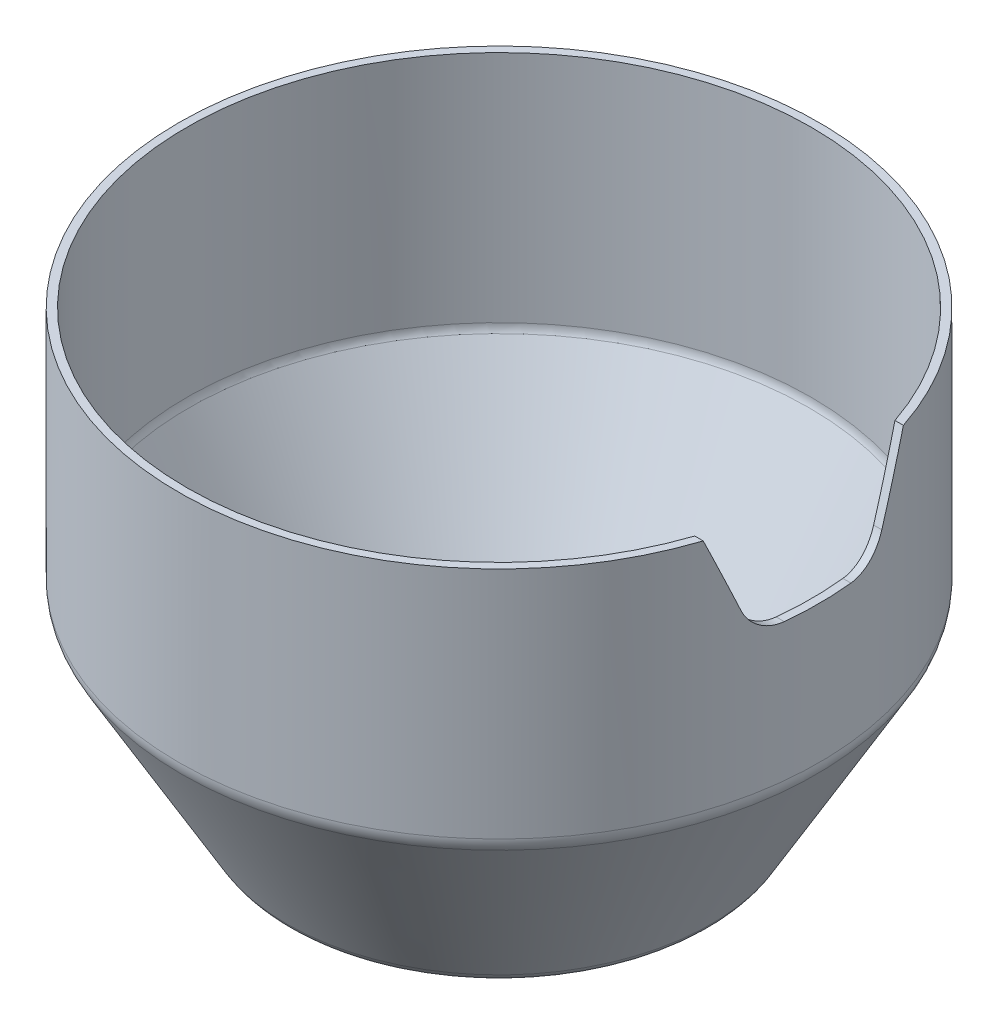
ISO-10303-21;
HEADER;
FILE_DESCRIPTION(('STEP AP214'),'2;1');
FILE_NAME('part.step','',(''),(''),'','','');
FILE_SCHEMA(('AUTOMOTIVE_DESIGN { 1 0 10303 214 1 1 1 1 }'));
ENDSEC;
DATA;
#1=APPLICATION_CONTEXT('core data for automotive mechanical design processes');
#2=APPLICATION_PROTOCOL_DEFINITION('international standard','automotive_design',2000,#1);
#3=PRODUCT_CONTEXT('',#1,'mechanical');
#4=PRODUCT('Part','Part','',(#3));
#5=PRODUCT_RELATED_PRODUCT_CATEGORY('part','',(#4));
#6=PRODUCT_DEFINITION_FORMATION('','',#4);
#7=PRODUCT_DEFINITION_CONTEXT('part definition',#1,'design');
#8=PRODUCT_DEFINITION('design','',#6,#7);
#9=PRODUCT_DEFINITION_SHAPE('','',#8);
#10=(LENGTH_UNIT() NAMED_UNIT(*) SI_UNIT(.MILLI.,.METRE.));
#11=(NAMED_UNIT(*) PLANE_ANGLE_UNIT() SI_UNIT($,.RADIAN.));
#12=(NAMED_UNIT(*) SI_UNIT($,.STERADIAN.) SOLID_ANGLE_UNIT());
#13=UNCERTAINTY_MEASURE_WITH_UNIT(LENGTH_MEASURE(1.E-05),#10,'distance_accuracy_value','');
#14=(GEOMETRIC_REPRESENTATION_CONTEXT(3) GLOBAL_UNCERTAINTY_ASSIGNED_CONTEXT((#13)) GLOBAL_UNIT_ASSIGNED_CONTEXT((#10,
#11,#12)) REPRESENTATION_CONTEXT('',''));
#15=CARTESIAN_POINT('',(0.,0.,0.));
#16=DIRECTION('',(0.,0.,1.));
#17=DIRECTION('',(1.,0.,0.));
#18=AXIS2_PLACEMENT_3D('',#15,#16,#17);
#19=CARTESIAN_POINT('',(0.,0.,0.));
#20=DIRECTION('',(0.,-1.,0.));
#21=DIRECTION('',(0.,0.,-1.));
#22=AXIS2_PLACEMENT_3D('',#19,#20,#21);
#23=CYLINDRICAL_SURFACE('',#22,40.);
#24=CARTESIAN_POINT('',(0.,25.7846096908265,0.));
#25=DIRECTION('',(0.,1.,0.));
#26=DIRECTION('',(0.,0.,1.));
#27=AXIS2_PLACEMENT_3D('',#24,#25,#26);
#28=CIRCLE('',#27,40.);
#29=CARTESIAN_POINT('',(0.,25.7846096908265,40.));
#30=VERTEX_POINT('',#29);
#31=EDGE_CURVE('E125',#30,#30,#28,.T.);
#32=ORIENTED_EDGE('',*,*,#31,.T.);
#33=EDGE_LOOP('',(#32));
#34=FACE_BOUND('',#33,.T.);
#35=CARTESIAN_POINT('',(0.,25.,0.));
#36=DIRECTION('',(0.,0.384615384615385,0.923076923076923));
#37=DIRECTION('',(0.,-0.923076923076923,0.384615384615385));
#38=AXIS2_PLACEMENT_3D('',#35,#36,#37);
#39=ELLIPSE('',#38,104.,40.);
#40=CARTESIAN_POINT('',(37.9967103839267,55.,-12.5));
#41=VERTEX_POINT('',#40);
#42=CARTESIAN_POINT('',(39.024038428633,46.0769230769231,-8.78205128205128));
#43=VERTEX_POINT('',#42);
#44=EDGE_CURVE('E88',#41,#43,#39,.F.);
#45=ORIENTED_EDGE('',*,*,#44,.T.);
#46=CARTESIAN_POINT('',(39.024038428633,46.0769230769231,-8.78205128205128));
#47=CARTESIAN_POINT('',(39.0362640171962,45.9464739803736,-8.7277137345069));
#48=CARTESIAN_POINT('',(39.0496169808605,45.8184393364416,-8.66786044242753));
#49=CARTESIAN_POINT('',(39.0782906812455,45.5680762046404,-8.53766321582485));
#50=CARTESIAN_POINT('',(39.0936110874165,45.4457467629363,-8.46732104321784));
#51=CARTESIAN_POINT('',(39.1259152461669,45.2077871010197,-8.31676964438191));
#52=CARTESIAN_POINT('',(39.1428967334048,45.0921480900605,-8.23657381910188));
#53=CARTESIAN_POINT('',(39.1782288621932,44.8681643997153,-8.06683948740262));
#54=CARTESIAN_POINT('',(39.1965795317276,44.7598198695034,-7.97730079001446));
#55=CARTESIAN_POINT('',(39.2343203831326,44.5511853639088,-7.78956124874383));
#56=CARTESIAN_POINT('',(39.2537101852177,44.450892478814,-7.69136356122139));
#57=CARTESIAN_POINT('',(39.2932142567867,44.2589435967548,-7.48693215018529));
#58=CARTESIAN_POINT('',(39.3133287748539,44.1672906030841,-7.38069565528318));
#59=CARTESIAN_POINT('',(39.3539520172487,43.9932526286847,-7.16093193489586));
#60=CARTESIAN_POINT('',(39.3744607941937,43.9108688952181,-7.04740373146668));
#61=CARTESIAN_POINT('',(39.4155509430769,43.7559313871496,-6.81383901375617));
#62=CARTESIAN_POINT('',(39.4361323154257,43.6833776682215,-6.69380246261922));
#63=CARTESIAN_POINT('',(39.477320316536,43.5477425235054,-6.44647896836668));
#64=CARTESIAN_POINT('',(39.497923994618,43.4847919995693,-6.31911971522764));
#65=CARTESIAN_POINT('',(39.5385881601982,43.369946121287,-6.05948062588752));
#66=CARTESIAN_POINT('',(39.5586488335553,43.3180469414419,-5.92720251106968));
#67=CARTESIAN_POINT('',(39.5979492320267,43.2256939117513,-5.65869334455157));
#68=CARTESIAN_POINT('',(39.6171895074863,43.1852322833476,-5.52246504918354));
#69=CARTESIAN_POINT('',(39.6546162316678,43.1160363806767,-5.24697388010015));
#70=CARTESIAN_POINT('',(39.6728030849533,43.0872975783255,-5.10771220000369));
#71=CARTESIAN_POINT('',(39.706917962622,43.0430735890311,-4.83512218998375));
#72=CARTESIAN_POINT('',(39.7229156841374,43.0269245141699,-4.70190992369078));
#73=CARTESIAN_POINT('',(39.7536350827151,43.0053914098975,-4.43471296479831));
#74=CARTESIAN_POINT('',(39.768358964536,42.9999884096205,-4.30073005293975));
#75=CARTESIAN_POINT('',(39.7823942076,43.,-4.16666666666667));
#76=B_SPLINE_CURVE_WITH_KNOTS('',3,(#46,#47,#48,#49,#50,#51,#52,#53,#54,#55,#56,#57,#58,#59,#60,
#61,#62,#63,#64,#65,#66,#67,#68,#69,#70,#71,#72,#73,#74,#75),.UNSPECIFIED.,.F.,.F.,(4,2,2,2,2,2,
2,2,2,2,2,2,2,2,4),(0.,0.425378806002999,0.850686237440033,1.275421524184,1.70016549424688,
2.12475527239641,2.54949210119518,2.97428601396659,3.39908233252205,3.82923229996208,
4.25923312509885,4.68894080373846,5.1184823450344,5.52346230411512,5.92772668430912),.UNSPECIFIED.);
#77=CARTESIAN_POINT('',(39.7823942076,43.,-4.16666666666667));
#78=VERTEX_POINT('',#77);
#79=EDGE_CURVE('E174',#43,#78,#76,.T.);
#80=ORIENTED_EDGE('',*,*,#79,.T.);
#81=CARTESIAN_POINT('',(0.,43.,0.));
#82=DIRECTION('',(0.,1.,0.));
#83=DIRECTION('',(0.,0.,1.));
#84=AXIS2_PLACEMENT_3D('',#81,#82,#83);
#85=CIRCLE('',#84,40.);
#86=CARTESIAN_POINT('',(39.7823942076,43.,4.16666666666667));
#87=VERTEX_POINT('',#86);
#88=EDGE_CURVE('E98',#78,#87,#85,.F.);
#89=ORIENTED_EDGE('',*,*,#88,.T.);
#90=CARTESIAN_POINT('',(39.7823942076,43.,4.16666666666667));
#91=CARTESIAN_POINT('',(39.7675515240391,42.999984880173,4.3084547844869));
#92=CARTESIAN_POINT('',(39.751936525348,43.0060304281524,4.45015559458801));
#93=CARTESIAN_POINT('',(39.7193248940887,43.0300904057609,4.7323608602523));
#94=CARTESIAN_POINT('',(39.7023284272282,43.0481034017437,4.8728654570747));
#95=CARTESIAN_POINT('',(39.6671341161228,43.0959175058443,5.15152557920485));
#96=CARTESIAN_POINT('',(39.6489377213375,43.1257046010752,5.28968369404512));
#97=CARTESIAN_POINT('',(39.6115337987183,43.196816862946,5.56285768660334));
#98=CARTESIAN_POINT('',(39.5923262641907,43.238142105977,5.69787354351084));
#99=CARTESIAN_POINT('',(39.5531419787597,43.3320070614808,5.96380972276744));
#100=CARTESIAN_POINT('',(39.5331653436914,43.3845450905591,6.09473065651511));
#101=CARTESIAN_POINT('',(39.4927016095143,43.5004752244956,6.35164842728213));
#102=CARTESIAN_POINT('',(39.4722143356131,43.5638710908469,6.4776435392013));
#103=CARTESIAN_POINT('',(39.4310264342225,43.7010659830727,6.72381835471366));
#104=CARTESIAN_POINT('',(39.4103257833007,43.7748661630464,6.8439974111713));
#105=CARTESIAN_POINT('',(39.3690252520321,43.9323592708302,7.0777068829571));
#106=CARTESIAN_POINT('',(39.348425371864,44.0160522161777,7.19123728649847));
#107=CARTESIAN_POINT('',(39.3074853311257,44.1934897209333,7.41176625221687));
#108=CARTESIAN_POINT('',(39.287148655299,44.2873106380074,7.51870404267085));
#109=CARTESIAN_POINT('',(39.2472562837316,44.4837664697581,7.72423664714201));
#110=CARTESIAN_POINT('',(39.2277003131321,44.5863982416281,7.82283441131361));
#111=CARTESIAN_POINT('',(39.1897178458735,44.79972784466,8.01094369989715));
#112=CARTESIAN_POINT('',(39.1712904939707,44.9104194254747,8.10046213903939));
#113=CARTESIAN_POINT('',(39.1358895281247,45.1391403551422,8.26980227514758));
#114=CARTESIAN_POINT('',(39.1189153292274,45.2571667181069,8.3496278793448));
#115=CARTESIAN_POINT('',(39.0880427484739,45.4899066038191,8.49292965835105));
#116=CARTESIAN_POINT('',(39.0740064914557,45.6041090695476,8.55720747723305));
#117=CARTESIAN_POINT('',(39.0476726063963,45.8371623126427,8.67657490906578));
#118=CARTESIAN_POINT('',(39.0353720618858,45.956004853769,8.73167996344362));
#119=CARTESIAN_POINT('',(39.024038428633,46.0769230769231,8.78205128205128));
#120=B_SPLINE_CURVE_WITH_KNOTS('',3,(#90,#91,#92,#93,#94,#95,#96,#97,#98,#99,#100,#101,#102,
#103,#104,#105,#106,#107,#108,#109,#110,#111,#112,#113,#114,#115,#116,#117,#118,#119),
.UNSPECIFIED.,.F.,.F.,(4,2,2,2,2,2,2,2,2,2,2,2,2,2,4),(0.,0.427549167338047,0.855047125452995,
1.28203782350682,1.70903134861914,2.1359608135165,2.56303848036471,2.99016355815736,
3.41728939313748,3.84789611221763,4.27834986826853,4.70847329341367,5.13842275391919,
5.53340992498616,5.92772529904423),.UNSPECIFIED.);
#121=CARTESIAN_POINT('',(39.024038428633,46.0769230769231,8.78205128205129));
#122=VERTEX_POINT('',#121);
#123=EDGE_CURVE('E11',#87,#122,#120,.T.);
#124=ORIENTED_EDGE('',*,*,#123,.T.);
#125=CARTESIAN_POINT('',(0.,25.,0.));
#126=DIRECTION('',(0.,0.384615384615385,-0.923076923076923));
#127=DIRECTION('',(0.,-0.923076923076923,-0.384615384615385));
#128=AXIS2_PLACEMENT_3D('',#125,#126,#127);
#129=ELLIPSE('',#128,104.,40.);
#130=CARTESIAN_POINT('',(37.9967103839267,55.,12.5));
#131=VERTEX_POINT('',#130);
#132=EDGE_CURVE('E109',#122,#131,#129,.F.);
#133=ORIENTED_EDGE('',*,*,#132,.T.);
#134=CARTESIAN_POINT('',(0.,55.,0.));
#135=DIRECTION('',(0.,-1.,0.));
#136=DIRECTION('',(0.,0.,-1.));
#137=AXIS2_PLACEMENT_3D('',#134,#135,#136);
#138=CIRCLE('',#137,40.);
#139=EDGE_CURVE('E105',#131,#41,#138,.T.);
#140=ORIENTED_EDGE('',*,*,#139,.T.);
#141=EDGE_LOOP('',(#45,#80,#89,#124,#133,#140));
#142=FACE_BOUND('',#141,.T.);
#143=ADVANCED_FACE('F31',(#34,#142),#23,.T.);
#144=CARTESIAN_POINT('',(40.,55.,0.));
#145=DIRECTION('',(0.,1.,0.));
#146=DIRECTION('',(0.,0.,1.));
#147=AXIS2_PLACEMENT_3D('',#144,#145,#146);
#148=PLANE('',#147);
#149=ORIENTED_EDGE('',*,*,#139,.F.);
#150=DIRECTION('',(-1.,0.,0.));
#151=VECTOR('',#150,1.);
#152=CARTESIAN_POINT('',(40.,55.,12.5));
#153=LINE('',#152,#151);
#154=CARTESIAN_POINT('',(36.9425229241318,55.,12.5));
#155=VERTEX_POINT('',#154);
#156=EDGE_CURVE('E99',#131,#155,#153,.T.);
#157=ORIENTED_EDGE('',*,*,#156,.T.);
#158=CARTESIAN_POINT('',(0.,55.,0.));
#159=DIRECTION('',(0.,-1.,0.));
#160=DIRECTION('',(0.,0.,-1.));
#161=AXIS2_PLACEMENT_3D('',#158,#159,#160);
#162=CIRCLE('',#161,39.);
#163=CARTESIAN_POINT('',(36.9425229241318,55.,-12.5));
#164=VERTEX_POINT('',#163);
#165=EDGE_CURVE('E107',#155,#164,#162,.T.);
#166=ORIENTED_EDGE('',*,*,#165,.T.);
#167=DIRECTION('',(-1.,0.,0.));
#168=VECTOR('',#167,1.);
#169=CARTESIAN_POINT('',(40.,55.,-12.5));
#170=LINE('',#169,#168);
#171=EDGE_CURVE('E92',#41,#164,#170,.T.);
#172=ORIENTED_EDGE('',*,*,#171,.F.);
#173=EDGE_LOOP('',(#149,#157,#166,#172));
#174=FACE_BOUND('',#173,.T.);
#175=ADVANCED_FACE('F103',(#174),#148,.T.);
#176=CARTESIAN_POINT('',(0.,0.,0.));
#177=DIRECTION('',(0.,-1.,0.));
#178=DIRECTION('',(0.,0.,-1.));
#179=AXIS2_PLACEMENT_3D('',#176,#177,#178);
#180=CYLINDRICAL_SURFACE('',#179,39.);
#181=CARTESIAN_POINT('',(0.,25.7846096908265,0.));
#182=DIRECTION('',(0.,-1.,0.));
#183=DIRECTION('',(0.,0.,-1.));
#184=AXIS2_PLACEMENT_3D('',#181,#182,#183);
#185=CIRCLE('',#184,39.);
#186=CARTESIAN_POINT('',(0.,25.7846096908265,-39.));
#187=VERTEX_POINT('',#186);
#188=EDGE_CURVE('E128',#187,#187,#185,.T.);
#189=ORIENTED_EDGE('',*,*,#188,.T.);
#190=EDGE_LOOP('',(#189));
#191=FACE_BOUND('',#190,.T.);
#192=ORIENTED_EDGE('',*,*,#165,.F.);
#193=CARTESIAN_POINT('',(0.,25.,0.));
#194=DIRECTION('',(0.,0.384615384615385,-0.923076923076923));
#195=DIRECTION('',(0.,-0.923076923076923,-0.384615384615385));
#196=AXIS2_PLACEMENT_3D('',#193,#194,#195);
#197=ELLIPSE('',#196,101.4,39.);
#198=CARTESIAN_POINT('',(37.9983627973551,46.0769230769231,8.78205128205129));
#199=VERTEX_POINT('',#198);
#200=EDGE_CURVE('E156',#155,#199,#197,.T.);
#201=ORIENTED_EDGE('',*,*,#200,.T.);
#202=CARTESIAN_POINT('',(37.9983627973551,46.0769230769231,8.78205128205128));
#203=CARTESIAN_POINT('',(38.010921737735,45.9464393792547,8.7276993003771));
#204=CARTESIAN_POINT('',(38.024638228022,45.8183766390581,8.66783088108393));
#205=CARTESIAN_POINT('',(38.0540905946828,45.5679699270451,8.53760490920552));
#206=CARTESIAN_POINT('',(38.0698261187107,45.4456249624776,8.46724918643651));
#207=CARTESIAN_POINT('',(38.103002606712,45.2076482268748,8.31667657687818));
#208=CARTESIAN_POINT('',(38.1204411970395,45.0920074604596,8.23647337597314));
#209=CARTESIAN_POINT('',(38.1567216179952,44.8680277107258,8.06672977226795));
#210=CARTESIAN_POINT('',(38.1755634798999,44.7596888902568,7.9771891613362));
#211=CARTESIAN_POINT('',(38.2143111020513,44.5510739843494,7.78945478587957));
#212=CARTESIAN_POINT('',(38.2342164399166,44.4507947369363,7.69126444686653));
#213=CARTESIAN_POINT('',(38.2747681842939,44.2588746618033,7.48685374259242));
#214=CARTESIAN_POINT('',(38.2954148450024,44.1672368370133,7.38063060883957));
#215=CARTESIAN_POINT('',(38.3371108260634,43.9932267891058,7.16089645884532));
#216=CARTESIAN_POINT('',(38.3581602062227,43.9108559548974,7.04738435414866));
#217=CARTESIAN_POINT('',(38.4003316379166,43.7559414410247,6.81385403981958));
#218=CARTESIAN_POINT('',(38.4214536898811,43.6833978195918,6.69383579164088));
#219=CARTESIAN_POINT('',(38.4637357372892,43.5477359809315,6.44647049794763));
#220=CARTESIAN_POINT('',(38.4848925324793,43.4847552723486,6.31904745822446));
#221=CARTESIAN_POINT('',(38.5266468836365,43.3698586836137,6.05927216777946));
#222=CARTESIAN_POINT('',(38.5472446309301,43.3179389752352,5.92692164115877));
#223=CARTESIAN_POINT('',(38.5875955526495,43.2255561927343,5.65825983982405));
#224=CARTESIAN_POINT('',(38.6073493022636,43.1850852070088,5.52195137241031));
#225=CARTESIAN_POINT('',(38.6457733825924,43.1158828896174,5.24629061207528));
#226=CARTESIAN_POINT('',(38.6644441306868,43.087147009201,5.10693952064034));
#227=CARTESIAN_POINT('',(38.6994347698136,43.0429809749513,4.83440419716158));
#228=CARTESIAN_POINT('',(38.7158283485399,43.0268671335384,4.70133983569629));
#229=CARTESIAN_POINT('',(38.7473090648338,43.0053803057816,4.43443280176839));
#230=CARTESIAN_POINT('',(38.7623984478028,42.9999884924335,4.3005919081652));
#231=CARTESIAN_POINT('',(38.7767828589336,43.,4.16666666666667));
#232=B_SPLINE_CURVE_WITH_KNOTS('',3,(#202,#203,#204,#205,#206,#207,#208,#209,#210,#211,#212,
#213,#214,#215,#216,#217,#218,#219,#220,#221,#222,#223,#224,#225,#226,#227,#228,#229,#230,#231),
.UNSPECIFIED.,.F.,.F.,(4,2,2,2,2,2,2,2,2,2,2,2,2,2,4),(0.,0.425577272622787,0.851080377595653,
1.27599867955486,1.70092645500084,2.12568669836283,2.55059400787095,2.9755649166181,
3.40053834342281,3.831138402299,4.26158918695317,4.69174177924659,5.1217274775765,
5.52640127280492,5.93036386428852),.UNSPECIFIED.);
#233=CARTESIAN_POINT('',(38.7767828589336,43.,4.16666666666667));
#234=VERTEX_POINT('',#233);
#235=EDGE_CURVE('E44',#199,#234,#232,.T.);
#236=ORIENTED_EDGE('',*,*,#235,.T.);
#237=CARTESIAN_POINT('',(0.,43.,0.));
#238=DIRECTION('',(0.,1.,0.));
#239=DIRECTION('',(0.,0.,1.));
#240=AXIS2_PLACEMENT_3D('',#237,#238,#239);
#241=CIRCLE('',#240,39.);
#242=CARTESIAN_POINT('',(38.7767828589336,43.,-4.16666666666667));
#243=VERTEX_POINT('',#242);
#244=EDGE_CURVE('E153',#234,#243,#241,.T.);
#245=ORIENTED_EDGE('',*,*,#244,.T.);
#246=CARTESIAN_POINT('',(38.7767828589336,43.,-4.16666666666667));
#247=CARTESIAN_POINT('',(38.7615488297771,42.9999848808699,-4.30851467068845));
#248=CARTESIAN_POINT('',(38.7455218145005,43.0060355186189,-4.45027081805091));
#249=CARTESIAN_POINT('',(38.7120492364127,43.0301135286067,-4.73257661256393));
#250=CARTESIAN_POINT('',(38.6946038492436,43.0481394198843,-4.87312640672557));
#251=CARTESIAN_POINT('',(38.6584799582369,43.0959842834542,-5.15186364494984));
#252=CARTESIAN_POINT('',(38.639802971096,43.1257889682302,-5.29005374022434));
#253=CARTESIAN_POINT('',(38.6014107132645,43.19693945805,-5.56328254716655));
#254=CARTESIAN_POINT('',(38.5816954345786,43.2382853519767,-5.69832123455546));
#255=CARTESIAN_POINT('',(38.5414751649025,43.3321922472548,-5.96429239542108));
#256=CARTESIAN_POINT('',(38.5209703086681,43.3847513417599,-6.09522556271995));
#257=CARTESIAN_POINT('',(38.479435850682,43.5007240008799,-6.35216176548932));
#258=CARTESIAN_POINT('',(38.4584060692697,43.5641413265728,-6.47816307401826));
#259=CARTESIAN_POINT('',(38.4161261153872,43.7013806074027,-6.7243481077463));
#260=CARTESIAN_POINT('',(38.3948759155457,43.7752038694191,-6.84453109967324));
#261=CARTESIAN_POINT('',(38.3524776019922,43.9327447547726,-7.0782462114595));
#262=CARTESIAN_POINT('',(38.3313294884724,44.0164623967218,-7.19177831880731));
#263=CARTESIAN_POINT('',(38.2892896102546,44.193989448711,-7.41235568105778));
#264=CARTESIAN_POINT('',(38.2684015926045,44.2878791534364,-7.51933704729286));
#265=CARTESIAN_POINT('',(38.2274265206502,44.4844848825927,-7.72494979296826));
#266=CARTESIAN_POINT('',(38.2073391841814,44.5871977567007,-7.82358412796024));
#267=CARTESIAN_POINT('',(38.1683242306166,44.8007016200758,-8.01175729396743));
#268=CARTESIAN_POINT('',(38.1493957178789,44.9114862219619,-8.1013031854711));
#269=CARTESIAN_POINT('',(38.1130319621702,45.1404077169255,-8.27068888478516));
#270=CARTESIAN_POINT('',(38.0955961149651,45.2585416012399,-8.35053262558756));
#271=CARTESIAN_POINT('',(38.0639308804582,45.4911641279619,-8.49364995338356));
#272=CARTESIAN_POINT('',(38.049555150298,45.6051237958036,-8.55775237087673));
#273=CARTESIAN_POINT('',(38.0225798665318,45.8376783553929,-8.67681389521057));
#274=CARTESIAN_POINT('',(38.009977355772,45.9562650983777,-8.73178825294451));
#275=CARTESIAN_POINT('',(37.9983627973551,46.0769230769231,-8.78205128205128));
#276=B_SPLINE_CURVE_WITH_KNOTS('',3,(#246,#247,#248,#249,#250,#251,#252,#253,#254,#255,#256,
#257,#258,#259,#260,#261,#262,#263,#264,#265,#266,#267,#268,#269,#270,#271,#272,#273,#274,#275),
.UNSPECIFIED.,.F.,.F.,(4,2,2,2,2,2,2,2,2,2,2,2,2,2,4),(0.,0.427851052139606,0.855649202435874,
1.28293002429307,1.7102141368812,2.13742564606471,2.56478543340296,2.99219894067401,
3.41961325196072,3.85068837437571,4.28161021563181,4.71219468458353,5.14260401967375,
5.53681590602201,5.93036237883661),.UNSPECIFIED.);
#277=CARTESIAN_POINT('',(37.9983627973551,46.0769230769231,-8.78205128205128));
#278=VERTEX_POINT('',#277);
#279=EDGE_CURVE('E167',#243,#278,#276,.T.);
#280=ORIENTED_EDGE('',*,*,#279,.T.);
#281=CARTESIAN_POINT('',(0.,25.,0.));
#282=DIRECTION('',(0.,0.384615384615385,0.923076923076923));
#283=DIRECTION('',(0.,-0.923076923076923,0.384615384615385));
#284=AXIS2_PLACEMENT_3D('',#281,#282,#283);
#285=ELLIPSE('',#284,101.4,39.);
#286=EDGE_CURVE('E140',#278,#164,#285,.T.);
#287=ORIENTED_EDGE('',*,*,#286,.T.);
#288=EDGE_LOOP('',(#192,#201,#236,#245,#280,#287));
#289=FACE_BOUND('',#288,.T.);
#290=ADVANCED_FACE('F181',(#191,#289),#180,.F.);
#291=CARTESIAN_POINT('',(0.,0.,0.));
#292=DIRECTION('',(0.,-1.,0.));
#293=DIRECTION('',(0.,0.,-1.));
#294=AXIS2_PLACEMENT_3D('',#291,#292,#293);
#295=PLANE('',#294);
#296=CARTESIAN_POINT('',(0.,0.,-18.));
#297=DIRECTION('',(0.,-1.,0.));
#298=DIRECTION('',(0.,0.,-1.));
#299=AXIS2_PLACEMENT_3D('',#296,#297,#298);
#300=CIRCLE('',#299,3.);
#301=CARTESIAN_POINT('',(0.,0.,-21.));
#302=VERTEX_POINT('',#301);
#303=EDGE_CURVE('E151',#302,#302,#300,.T.);
#304=ORIENTED_EDGE('',*,*,#303,.F.);
#305=EDGE_LOOP('',(#304));
#306=FACE_BOUND('',#305,.T.);
#307=CARTESIAN_POINT('',(0.,0.,18.));
#308=DIRECTION('',(0.,-1.,0.));
#309=DIRECTION('',(0.,0.,-1.));
#310=AXIS2_PLACEMENT_3D('',#307,#308,#309);
#311=CIRCLE('',#310,3.);
#312=CARTESIAN_POINT('',(0.,0.,15.));
#313=VERTEX_POINT('',#312);
#314=EDGE_CURVE('E147',#313,#313,#311,.T.);
#315=ORIENTED_EDGE('',*,*,#314,.F.);
#316=EDGE_LOOP('',(#315));
#317=FACE_BOUND('',#316,.T.);
#318=CARTESIAN_POINT('',(0.,0.,0.));
#319=DIRECTION('',(0.,-1.,0.));
#320=DIRECTION('',(0.,0.,-1.));
#321=AXIS2_PLACEMENT_3D('',#318,#319,#320);
#322=CIRCLE('',#321,11.);
#323=CARTESIAN_POINT('',(0.,0.,-11.));
#324=VERTEX_POINT('',#323);
#325=EDGE_CURVE('E143',#324,#324,#322,.T.);
#326=ORIENTED_EDGE('',*,*,#325,.F.);
#327=EDGE_LOOP('',(#326));
#328=FACE_BOUND('',#327,.T.);
#329=CARTESIAN_POINT('',(0.,0.,0.));
#330=DIRECTION('',(0.,-1.,0.));
#331=DIRECTION('',(0.,0.,-1.));
#332=AXIS2_PLACEMENT_3D('',#329,#330,#331);
#333=CIRCLE('',#332,23.8452994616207);
#334=CARTESIAN_POINT('',(0.,0.,-23.8452994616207));
#335=VERTEX_POINT('',#334);
#336=EDGE_CURVE('E111',#335,#335,#333,.T.);
#337=ORIENTED_EDGE('',*,*,#336,.T.);
#338=EDGE_LOOP('',(#337));
#339=FACE_BOUND('',#338,.T.);
#340=ADVANCED_FACE('F33',(#306,#317,#328,#339),#295,.T.);
#341=CARTESIAN_POINT('',(0.,0.,0.));
#342=DIRECTION('',(0.,1.,0.));
#343=DIRECTION('',(0.,0.,1.));
#344=AXIS2_PLACEMENT_3D('',#341,#342,#343);
#345=CONICAL_SURFACE('',#344,25.5773502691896,0.5235987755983);
#346=CARTESIAN_POINT('',(0.,1.5,0.));
#347=DIRECTION('',(0.,-1.,0.));
#348=DIRECTION('',(0.,0.,-1.));
#349=AXIS2_PLACEMENT_3D('',#346,#347,#348);
#350=CIRCLE('',#349,26.4433756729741);
#351=CARTESIAN_POINT('',(0.,1.5,-26.4433756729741));
#352=VERTEX_POINT('',#351);
#353=EDGE_CURVE('E122',#352,#352,#350,.F.);
#354=ORIENTED_EDGE('',*,*,#353,.T.);
#355=EDGE_LOOP('',(#354));
#356=FACE_BOUND('',#355,.T.);
#357=CARTESIAN_POINT('',(0.,24.2846096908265,0.));
#358=DIRECTION('',(0.,-1.,0.));
#359=DIRECTION('',(0.,0.,-1.));
#360=AXIS2_PLACEMENT_3D('',#357,#358,#359);
#361=CIRCLE('',#360,39.5980762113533);
#362=CARTESIAN_POINT('',(0.,24.2846096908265,-39.5980762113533));
#363=VERTEX_POINT('',#362);
#364=EDGE_CURVE('E114',#363,#363,#361,.T.);
#365=ORIENTED_EDGE('',*,*,#364,.T.);
#366=EDGE_LOOP('',(#365));
#367=FACE_BOUND('',#366,.T.);
#368=ADVANCED_FACE('F207',(#356,#367),#345,.T.);
#369=CARTESIAN_POINT('',(0.,25.2487113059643,0.));
#370=DIRECTION('',(0.,1.,0.));
#371=DIRECTION('',(0.,0.,1.));
#372=AXIS2_PLACEMENT_3D('',#369,#370,#371);
#373=CONICAL_SURFACE('',#372,39.,0.523598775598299);
#374=CARTESIAN_POINT('',(0.,24.7846096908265,0.));
#375=DIRECTION('',(0.,1.,0.));
#376=DIRECTION('',(0.,0.,1.));
#377=AXIS2_PLACEMENT_3D('',#374,#375,#376);
#378=CIRCLE('',#377,38.7320508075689);
#379=CARTESIAN_POINT('',(0.,24.7846096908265,38.7320508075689));
#380=VERTEX_POINT('',#379);
#381=EDGE_CURVE('E134',#380,#380,#378,.T.);
#382=ORIENTED_EDGE('',*,*,#381,.T.);
#383=EDGE_LOOP('',(#382));
#384=FACE_BOUND('',#383,.T.);
#385=CARTESIAN_POINT('',(0.,2.,0.));
#386=DIRECTION('',(0.,1.,0.));
#387=DIRECTION('',(0.,0.,1.));
#388=AXIS2_PLACEMENT_3D('',#385,#386,#387);
#389=CIRCLE('',#388,25.5773502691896);
#390=CARTESIAN_POINT('',(0.,2.,25.5773502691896));
#391=VERTEX_POINT('',#390);
#392=EDGE_CURVE('E131',#391,#391,#389,.F.);
#393=ORIENTED_EDGE('',*,*,#392,.T.);
#394=EDGE_LOOP('',(#393));
#395=FACE_BOUND('',#394,.T.);
#396=ADVANCED_FACE('F187',(#384,#395),#373,.F.);
#397=CARTESIAN_POINT('',(25.,1.,0.));
#398=DIRECTION('',(0.,1.,0.));
#399=DIRECTION('',(0.,0.,1.));
#400=AXIS2_PLACEMENT_3D('',#397,#398,#399);
#401=PLANE('',#400);
#402=CARTESIAN_POINT('',(0.,1.,-18.));
#403=DIRECTION('',(0.,1.,0.));
#404=DIRECTION('',(0.,0.,1.));
#405=AXIS2_PLACEMENT_3D('',#402,#403,#404);
#406=CIRCLE('',#405,3.);
#407=CARTESIAN_POINT('',(0.,1.,-15.));
#408=VERTEX_POINT('',#407);
#409=EDGE_CURVE('E148',#408,#408,#406,.T.);
#410=ORIENTED_EDGE('',*,*,#409,.F.);
#411=EDGE_LOOP('',(#410));
#412=FACE_BOUND('',#411,.T.);
#413=CARTESIAN_POINT('',(0.,1.,18.));
#414=DIRECTION('',(0.,1.,0.));
#415=DIRECTION('',(0.,0.,1.));
#416=AXIS2_PLACEMENT_3D('',#413,#414,#415);
#417=CIRCLE('',#416,3.);
#418=CARTESIAN_POINT('',(0.,1.,21.));
#419=VERTEX_POINT('',#418);
#420=EDGE_CURVE('E144',#419,#419,#417,.T.);
#421=ORIENTED_EDGE('',*,*,#420,.F.);
#422=EDGE_LOOP('',(#421));
#423=FACE_BOUND('',#422,.T.);
#424=CARTESIAN_POINT('',(0.,1.,0.));
#425=DIRECTION('',(0.,1.,0.));
#426=DIRECTION('',(0.,0.,1.));
#427=AXIS2_PLACEMENT_3D('',#424,#425,#426);
#428=CIRCLE('',#427,11.);
#429=CARTESIAN_POINT('',(0.,1.,11.));
#430=VERTEX_POINT('',#429);
#431=EDGE_CURVE('E116',#430,#430,#428,.T.);
#432=ORIENTED_EDGE('',*,*,#431,.F.);
#433=EDGE_LOOP('',(#432));
#434=FACE_BOUND('',#433,.T.);
#435=CARTESIAN_POINT('',(0.,1.,0.));
#436=DIRECTION('',(0.,1.,0.));
#437=DIRECTION('',(0.,0.,1.));
#438=AXIS2_PLACEMENT_3D('',#435,#436,#437);
#439=CIRCLE('',#438,23.8452994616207);
#440=CARTESIAN_POINT('',(0.,1.,23.8452994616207));
#441=VERTEX_POINT('',#440);
#442=EDGE_CURVE('E137',#441,#441,#439,.T.);
#443=ORIENTED_EDGE('',*,*,#442,.T.);
#444=EDGE_LOOP('',(#443));
#445=FACE_BOUND('',#444,.T.);
#446=ADVANCED_FACE('F215',(#412,#423,#434,#445),#401,.T.);
#447=CARTESIAN_POINT('',(0.,3.,0.));
#448=DIRECTION('',(0.,-1.,0.));
#449=DIRECTION('',(0.,0.,-1.));
#450=AXIS2_PLACEMENT_3D('',#447,#448,#449);
#451=TOROIDAL_SURFACE('',#450,23.8452994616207,3.);
#452=ORIENTED_EDGE('',*,*,#353,.F.);
#453=EDGE_LOOP('',(#452));
#454=FACE_BOUND('',#453,.T.);
#455=ORIENTED_EDGE('',*,*,#336,.F.);
#456=EDGE_LOOP('',(#455));
#457=FACE_BOUND('',#456,.T.);
#458=ADVANCED_FACE('F225',(#454,#457),#451,.T.);
#459=CARTESIAN_POINT('',(0.,25.7846096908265,0.));
#460=DIRECTION('',(0.,1.,0.));
#461=DIRECTION('',(0.,0.,1.));
#462=AXIS2_PLACEMENT_3D('',#459,#460,#461);
#463=TOROIDAL_SURFACE('',#462,37.,3.);
#464=ORIENTED_EDGE('',*,*,#31,.F.);
#465=EDGE_LOOP('',(#464));
#466=FACE_BOUND('',#465,.T.);
#467=ORIENTED_EDGE('',*,*,#364,.F.);
#468=EDGE_LOOP('',(#467));
#469=FACE_BOUND('',#468,.T.);
#470=ADVANCED_FACE('F222',(#466,#469),#463,.T.);
#471=CARTESIAN_POINT('',(0.,25.7846096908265,0.));
#472=DIRECTION('',(0.,-1.,0.));
#473=DIRECTION('',(0.,0.,-1.));
#474=AXIS2_PLACEMENT_3D('',#471,#472,#473);
#475=TOROIDAL_SURFACE('',#474,37.,2.);
#476=ORIENTED_EDGE('',*,*,#381,.F.);
#477=EDGE_LOOP('',(#476));
#478=FACE_BOUND('',#477,.T.);
#479=ORIENTED_EDGE('',*,*,#188,.F.);
#480=EDGE_LOOP('',(#479));
#481=FACE_BOUND('',#480,.T.);
#482=ADVANCED_FACE('F224',(#478,#481),#475,.F.);
#483=CARTESIAN_POINT('',(0.,3.,0.));
#484=DIRECTION('',(0.,1.,0.));
#485=DIRECTION('',(0.,0.,1.));
#486=AXIS2_PLACEMENT_3D('',#483,#484,#485);
#487=TOROIDAL_SURFACE('',#486,23.8452994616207,2.);
#488=ORIENTED_EDGE('',*,*,#442,.F.);
#489=EDGE_LOOP('',(#488));
#490=FACE_BOUND('',#489,.T.);
#491=ORIENTED_EDGE('',*,*,#392,.F.);
#492=EDGE_LOOP('',(#491));
#493=FACE_BOUND('',#492,.T.);
#494=ADVANCED_FACE('F232',(#490,#493),#487,.F.);
#495=CARTESIAN_POINT('',(0.,55.,0.));
#496=DIRECTION('',(0.,-1.,0.));
#497=DIRECTION('',(0.,0.,-1.));
#498=AXIS2_PLACEMENT_3D('',#495,#496,#497);
#499=CYLINDRICAL_SURFACE('',#498,11.);
#500=ORIENTED_EDGE('',*,*,#431,.T.);
#501=EDGE_LOOP('',(#500));
#502=FACE_BOUND('',#501,.T.);
#503=ORIENTED_EDGE('',*,*,#325,.T.);
#504=EDGE_LOOP('',(#503));
#505=FACE_BOUND('',#504,.T.);
#506=ADVANCED_FACE('F253',(#502,#505),#499,.F.);
#507=CARTESIAN_POINT('',(0.,55.,18.));
#508=DIRECTION('',(0.,-1.,0.));
#509=DIRECTION('',(0.,0.,-1.));
#510=AXIS2_PLACEMENT_3D('',#507,#508,#509);
#511=CYLINDRICAL_SURFACE('',#510,3.);
#512=ORIENTED_EDGE('',*,*,#420,.T.);
#513=EDGE_LOOP('',(#512));
#514=FACE_BOUND('',#513,.T.);
#515=ORIENTED_EDGE('',*,*,#314,.T.);
#516=EDGE_LOOP('',(#515));
#517=FACE_BOUND('',#516,.T.);
#518=ADVANCED_FACE('F259',(#514,#517),#511,.F.);
#519=CARTESIAN_POINT('',(0.,55.,-18.));
#520=DIRECTION('',(0.,-1.,0.));
#521=DIRECTION('',(0.,0.,-1.));
#522=AXIS2_PLACEMENT_3D('',#519,#520,#521);
#523=CYLINDRICAL_SURFACE('',#522,3.);
#524=ORIENTED_EDGE('',*,*,#409,.T.);
#525=EDGE_LOOP('',(#524));
#526=FACE_BOUND('',#525,.T.);
#527=ORIENTED_EDGE('',*,*,#303,.T.);
#528=EDGE_LOOP('',(#527));
#529=FACE_BOUND('',#528,.T.);
#530=ADVANCED_FACE('F265',(#526,#529),#523,.F.);
#531=CARTESIAN_POINT('',(40.,55.,12.5));
#532=DIRECTION('',(0.,0.384615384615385,-0.923076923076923));
#533=DIRECTION('',(0.,0.923076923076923,0.384615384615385));
#534=AXIS2_PLACEMENT_3D('',#531,#532,#533);
#535=PLANE('',#534);
#536=ORIENTED_EDGE('',*,*,#132,.F.);
#537=DIRECTION('',(-1.,0.,0.));
#538=VECTOR('',#537,1.);
#539=CARTESIAN_POINT('',(38.2720524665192,46.0769230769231,8.78205128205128));
#540=LINE('',#539,#538);
#541=EDGE_CURVE('E165',#122,#199,#540,.T.);
#542=ORIENTED_EDGE('',*,*,#541,.T.);
#543=ORIENTED_EDGE('',*,*,#200,.F.);
#544=ORIENTED_EDGE('',*,*,#156,.F.);
#545=EDGE_LOOP('',(#536,#542,#543,#544));
#546=FACE_BOUND('',#545,.T.);
#547=ADVANCED_FACE('F269',(#546),#535,.T.);
#548=CARTESIAN_POINT('',(40.,43.,7.5));
#549=DIRECTION('',(0.,1.,0.));
#550=DIRECTION('',(0.,0.,1.));
#551=AXIS2_PLACEMENT_3D('',#548,#549,#550);
#552=PLANE('',#551);
#553=ORIENTED_EDGE('',*,*,#88,.F.);
#554=DIRECTION('',(-1.,0.,0.));
#555=VECTOR('',#554,1.);
#556=CARTESIAN_POINT('',(38.2720524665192,43.,-4.16666666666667));
#557=LINE('',#556,#555);
#558=EDGE_CURVE('E161',#78,#243,#557,.T.);
#559=ORIENTED_EDGE('',*,*,#558,.T.);
#560=ORIENTED_EDGE('',*,*,#244,.F.);
#561=DIRECTION('',(-1.,0.,0.));
#562=VECTOR('',#561,1.);
#563=CARTESIAN_POINT('',(39.2905841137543,43.,4.16666666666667));
#564=LINE('',#563,#562);
#565=EDGE_CURVE('E159',#234,#87,#564,.F.);
#566=ORIENTED_EDGE('',*,*,#565,.T.);
#567=EDGE_LOOP('',(#553,#559,#560,#566));
#568=FACE_BOUND('',#567,.T.);
#569=ADVANCED_FACE('F273',(#568),#552,.T.);
#570=CARTESIAN_POINT('',(40.,43.,-7.5));
#571=DIRECTION('',(0.,0.384615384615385,0.923076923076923));
#572=DIRECTION('',(0.,-0.923076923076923,0.384615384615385));
#573=AXIS2_PLACEMENT_3D('',#570,#571,#572);
#574=PLANE('',#573);
#575=ORIENTED_EDGE('',*,*,#286,.F.);
#576=DIRECTION('',(-1.,0.,0.));
#577=VECTOR('',#576,1.);
#578=CARTESIAN_POINT('',(39.2905841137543,46.0769230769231,-8.78205128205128));
#579=LINE('',#578,#577);
#580=EDGE_CURVE('E95',#278,#43,#579,.F.);
#581=ORIENTED_EDGE('',*,*,#580,.T.);
#582=ORIENTED_EDGE('',*,*,#44,.F.);
#583=ORIENTED_EDGE('',*,*,#171,.T.);
#584=EDGE_LOOP('',(#575,#581,#582,#583));
#585=FACE_BOUND('',#584,.T.);
#586=ADVANCED_FACE('F91',(#585),#574,.T.);
#587=CARTESIAN_POINT('',(40.,48.,-4.16666666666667));
#588=DIRECTION('',(1.,0.,0.));
#589=DIRECTION('',(0.,0.,-1.));
#590=AXIS2_PLACEMENT_3D('',#587,#588,#589);
#591=CYLINDRICAL_SURFACE('',#590,5.);
#592=ORIENTED_EDGE('',*,*,#79,.F.);
#593=ORIENTED_EDGE('',*,*,#580,.F.);
#594=ORIENTED_EDGE('',*,*,#279,.F.);
#595=ORIENTED_EDGE('',*,*,#558,.F.);
#596=EDGE_LOOP('',(#592,#593,#594,#595));
#597=FACE_BOUND('',#596,.T.);
#598=ADVANCED_FACE('F178',(#597),#591,.F.);
#599=CARTESIAN_POINT('',(40.,48.,4.16666666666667));
#600=DIRECTION('',(1.,0.,0.));
#601=DIRECTION('',(0.,0.,-1.));
#602=AXIS2_PLACEMENT_3D('',#599,#600,#601);
#603=CYLINDRICAL_SURFACE('',#602,5.);
#604=ORIENTED_EDGE('',*,*,#123,.F.);
#605=ORIENTED_EDGE('',*,*,#565,.F.);
#606=ORIENTED_EDGE('',*,*,#235,.F.);
#607=ORIENTED_EDGE('',*,*,#541,.F.);
#608=EDGE_LOOP('',(#604,#605,#606,#607));
#609=FACE_BOUND('',#608,.T.);
#610=ADVANCED_FACE('F193',(#609),#603,.F.);
#611=CLOSED_SHELL('',(#143,#175,#290,#340,#368,#396,#446,#458,#470,#482,#494,#506,#518,#530,
#547,#569,#586,#598,#610));
#612=MANIFOLD_SOLID_BREP('B2',#611);
#613=ADVANCED_BREP_SHAPE_REPRESENTATION('',(#18,#612),#14);
#614=SHAPE_DEFINITION_REPRESENTATION(#9,#613);
ENDSEC;
END-ISO-10303-21;
